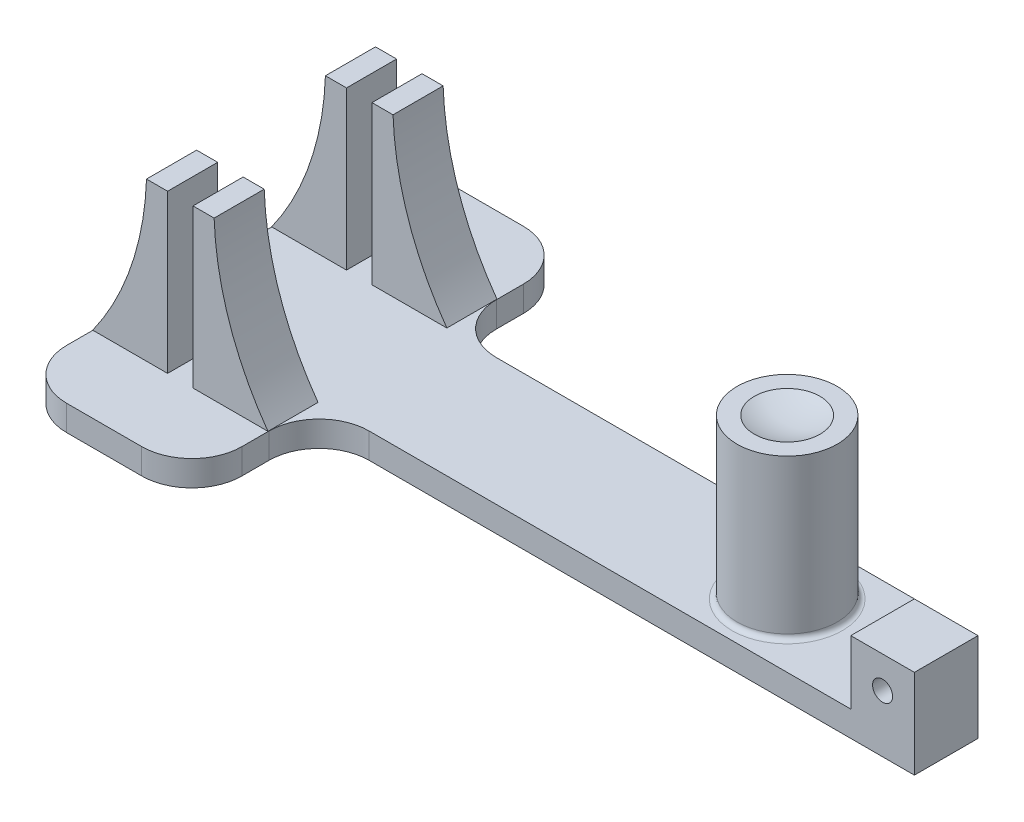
ISO-10303-21;
HEADER;
FILE_DESCRIPTION(('STEP AP214'),'2;1');
FILE_NAME('part.step','',(''),(''),'','','');
FILE_SCHEMA(('AUTOMOTIVE_DESIGN { 1 0 10303 214 1 1 1 1 }'));
ENDSEC;
DATA;
#1=APPLICATION_CONTEXT('core data for automotive mechanical design processes');
#2=APPLICATION_PROTOCOL_DEFINITION('international standard','automotive_design',2000,#1);
#3=PRODUCT_CONTEXT('',#1,'mechanical');
#4=PRODUCT('Part','Part','',(#3));
#5=PRODUCT_RELATED_PRODUCT_CATEGORY('part','',(#4));
#6=PRODUCT_DEFINITION_FORMATION('','',#4);
#7=PRODUCT_DEFINITION_CONTEXT('part definition',#1,'design');
#8=PRODUCT_DEFINITION('design','',#6,#7);
#9=PRODUCT_DEFINITION_SHAPE('','',#8);
#10=(LENGTH_UNIT() NAMED_UNIT(*) SI_UNIT(.MILLI.,.METRE.));
#11=(NAMED_UNIT(*) PLANE_ANGLE_UNIT() SI_UNIT($,.RADIAN.));
#12=(NAMED_UNIT(*) SI_UNIT($,.STERADIAN.) SOLID_ANGLE_UNIT());
#13=UNCERTAINTY_MEASURE_WITH_UNIT(LENGTH_MEASURE(1.E-05),#10,'distance_accuracy_value','');
#14=(GEOMETRIC_REPRESENTATION_CONTEXT(3) GLOBAL_UNCERTAINTY_ASSIGNED_CONTEXT((#13)) GLOBAL_UNIT_ASSIGNED_CONTEXT((#10,
#11,#12)) REPRESENTATION_CONTEXT('',''));
#15=CARTESIAN_POINT('',(0.,0.,0.));
#16=DIRECTION('',(0.,0.,1.));
#17=DIRECTION('',(1.,0.,0.));
#18=AXIS2_PLACEMENT_3D('',#15,#16,#17);
#19=CARTESIAN_POINT('',(30.08,0.,22.7));
#20=DIRECTION('',(0.,1.,0.));
#21=DIRECTION('',(0.,0.,1.));
#22=AXIS2_PLACEMENT_3D('',#19,#20,#21);
#23=PLANE('',#22);
#24=CARTESIAN_POINT('',(100.84,0.,0.));
#25=DIRECTION('',(0.,1.,0.));
#26=DIRECTION('',(0.,0.,1.));
#27=AXIS2_PLACEMENT_3D('',#24,#25,#26);
#28=CIRCLE('',#27,11.);
#29=CARTESIAN_POINT('',(100.84,0.,11.));
#30=VERTEX_POINT('',#29);
#31=EDGE_CURVE('E11',#30,#30,#28,.F.);
#32=ORIENTED_EDGE('',*,*,#31,.T.);
#33=EDGE_LOOP('',(#32));
#34=FACE_BOUND('',#33,.T.);
#35=DIRECTION('',(0.,0.,1.));
#36=VECTOR('',#35,1.);
#37=CARTESIAN_POINT('',(5.08,0.,12.86));
#38=LINE('',#37,#36);
#39=CARTESIAN_POINT('',(5.08,0.,12.86));
#40=VERTEX_POINT('',#39);
#41=CARTESIAN_POINT('',(5.08,0.,22.86));
#42=VERTEX_POINT('',#41);
#43=EDGE_CURVE('E375',#40,#42,#38,.T.);
#44=ORIENTED_EDGE('',*,*,#43,.F.);
#45=DIRECTION('',(1.,0.,0.));
#46=VECTOR('',#45,1.);
#47=CARTESIAN_POINT('',(5.08,0.,12.86));
#48=LINE('',#47,#46);
#49=CARTESIAN_POINT('',(20.033299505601,0.,12.86));
#50=VERTEX_POINT('',#49);
#51=EDGE_CURVE('E366',#40,#50,#48,.T.);
#52=ORIENTED_EDGE('',*,*,#51,.T.);
#53=DIRECTION('',(0.,0.,1.));
#54=VECTOR('',#53,1.);
#55=CARTESIAN_POINT('',(20.033299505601,0.,12.86));
#56=LINE('',#55,#54);
#57=CARTESIAN_POINT('',(20.033299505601,0.,22.86));
#58=VERTEX_POINT('',#57);
#59=EDGE_CURVE('E391',#50,#58,#56,.T.);
#60=ORIENTED_EDGE('',*,*,#59,.T.);
#61=DIRECTION('',(1.,0.,0.));
#62=VECTOR('',#61,1.);
#63=CARTESIAN_POINT('',(5.08,0.,22.86));
#64=LINE('',#63,#62);
#65=EDGE_CURVE('E378',#42,#58,#64,.T.);
#66=ORIENTED_EDGE('',*,*,#65,.F.);
#67=EDGE_LOOP('',(#44,#52,#60,#66));
#68=FACE_BOUND('',#67,.T.);
#69=DIRECTION('',(0.,0.,-1.));
#70=VECTOR('',#69,1.);
#71=CARTESIAN_POINT('',(20.033299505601,0.,-12.86));
#72=LINE('',#71,#70);
#73=CARTESIAN_POINT('',(20.033299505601,0.,-12.86));
#74=VERTEX_POINT('',#73);
#75=CARTESIAN_POINT('',(20.033299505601,0.,-22.86));
#76=VERTEX_POINT('',#75);
#77=EDGE_CURVE('E321',#74,#76,#72,.T.);
#78=ORIENTED_EDGE('',*,*,#77,.F.);
#79=DIRECTION('',(1.,0.,0.));
#80=VECTOR('',#79,1.);
#81=CARTESIAN_POINT('',(5.08,0.,-12.86));
#82=LINE('',#81,#80);
#83=CARTESIAN_POINT('',(5.08,0.,-12.86));
#84=VERTEX_POINT('',#83);
#85=EDGE_CURVE('E56',#84,#74,#82,.T.);
#86=ORIENTED_EDGE('',*,*,#85,.F.);
#87=DIRECTION('',(0.,0.,-1.));
#88=VECTOR('',#87,1.);
#89=CARTESIAN_POINT('',(5.08,0.,-12.86));
#90=LINE('',#89,#88);
#91=CARTESIAN_POINT('',(5.08,0.,-22.86));
#92=VERTEX_POINT('',#91);
#93=EDGE_CURVE('E318',#84,#92,#90,.T.);
#94=ORIENTED_EDGE('',*,*,#93,.T.);
#95=DIRECTION('',(1.,0.,0.));
#96=VECTOR('',#95,1.);
#97=CARTESIAN_POINT('',(5.08,0.,-22.86));
#98=LINE('',#97,#96);
#99=EDGE_CURVE('E305',#92,#76,#98,.T.);
#100=ORIENTED_EDGE('',*,*,#99,.T.);
#101=EDGE_LOOP('',(#78,#86,#94,#100));
#102=FACE_BOUND('',#101,.T.);
#103=DIRECTION('',(1.,0.,0.));
#104=VECTOR('',#103,1.);
#105=CARTESIAN_POINT('',(30.08,0.,12.7));
#106=LINE('',#105,#104);
#107=CARTESIAN_POINT('',(30.08,0.,12.7));
#108=VERTEX_POINT('',#107);
#109=CARTESIAN_POINT('',(126.24,0.,12.7));
#110=VERTEX_POINT('',#109);
#111=EDGE_CURVE('E48',#108,#110,#106,.T.);
#112=ORIENTED_EDGE('',*,*,#111,.T.);
#113=DIRECTION('',(0.,0.,1.));
#114=VECTOR('',#113,1.);
#115=CARTESIAN_POINT('',(126.24,0.,0.));
#116=LINE('',#115,#114);
#117=CARTESIAN_POINT('',(126.24,0.,0.));
#118=VERTEX_POINT('',#117);
#119=EDGE_CURVE('E287',#118,#110,#116,.T.);
#120=ORIENTED_EDGE('',*,*,#119,.F.);
#121=DIRECTION('',(0.,0.,-1.));
#122=VECTOR('',#121,1.);
#123=CARTESIAN_POINT('',(126.24,0.,-12.7));
#124=LINE('',#123,#122);
#125=CARTESIAN_POINT('',(126.24,0.,-12.7));
#126=VERTEX_POINT('',#125);
#127=EDGE_CURVE('E424',#118,#126,#124,.T.);
#128=ORIENTED_EDGE('',*,*,#127,.T.);
#129=DIRECTION('',(-1.,0.,0.));
#130=VECTOR('',#129,1.);
#131=CARTESIAN_POINT('',(30.08,0.,-12.7));
#132=LINE('',#131,#130);
#133=CARTESIAN_POINT('',(30.08,0.,-12.7));
#134=VERTEX_POINT('',#133);
#135=EDGE_CURVE('E479',#126,#134,#132,.T.);
#136=ORIENTED_EDGE('',*,*,#135,.T.);
#137=CARTESIAN_POINT('',(30.08,0.,-22.7));
#138=DIRECTION('',(0.,-1.,0.));
#139=DIRECTION('',(0.,0.,1.));
#140=AXIS2_PLACEMENT_3D('',#137,#138,#139);
#141=CIRCLE('',#140,10.);
#142=CARTESIAN_POINT('',(20.08,0.,-22.7));
#143=VERTEX_POINT('',#142);
#144=EDGE_CURVE('E482',#134,#143,#141,.T.);
#145=ORIENTED_EDGE('',*,*,#144,.T.);
#146=DIRECTION('',(0.,0.,-1.));
#147=VECTOR('',#146,1.);
#148=CARTESIAN_POINT('',(20.08,0.,-28.1));
#149=LINE('',#148,#147);
#150=CARTESIAN_POINT('',(20.08,0.,-28.1));
#151=VERTEX_POINT('',#150);
#152=EDGE_CURVE('E485',#143,#151,#149,.T.);
#153=ORIENTED_EDGE('',*,*,#152,.T.);
#154=CARTESIAN_POINT('',(10.08,0.,-28.1));
#155=DIRECTION('',(0.,1.,0.));
#156=DIRECTION('',(0.,0.,1.));
#157=AXIS2_PLACEMENT_3D('',#154,#155,#156);
#158=CIRCLE('',#157,10.);
#159=CARTESIAN_POINT('',(10.08,0.,-38.1));
#160=VERTEX_POINT('',#159);
#161=EDGE_CURVE('E488',#151,#160,#158,.T.);
#162=ORIENTED_EDGE('',*,*,#161,.T.);
#163=DIRECTION('',(-1.,0.,0.));
#164=VECTOR('',#163,1.);
#165=CARTESIAN_POINT('',(-4.92,0.,-38.1));
#166=LINE('',#165,#164);
#167=CARTESIAN_POINT('',(-4.91999999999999,0.,-38.1));
#168=VERTEX_POINT('',#167);
#169=EDGE_CURVE('E491',#160,#168,#166,.T.);
#170=ORIENTED_EDGE('',*,*,#169,.T.);
#171=CARTESIAN_POINT('',(-4.92,0.,-28.1));
#172=DIRECTION('',(0.,1.,0.));
#173=DIRECTION('',(0.,0.,1.));
#174=AXIS2_PLACEMENT_3D('',#171,#172,#173);
#175=CIRCLE('',#174,10.);
#176=CARTESIAN_POINT('',(-14.92,0.,-28.1));
#177=VERTEX_POINT('',#176);
#178=EDGE_CURVE('E494',#168,#177,#175,.T.);
#179=ORIENTED_EDGE('',*,*,#178,.T.);
#180=DIRECTION('',(0.,0.,1.));
#181=VECTOR('',#180,1.);
#182=CARTESIAN_POINT('',(-14.92,0.,-28.1));
#183=LINE('',#182,#181);
#184=CARTESIAN_POINT('',(-14.92,0.,-22.86));
#185=VERTEX_POINT('',#184);
#186=EDGE_CURVE('E498',#177,#185,#183,.T.);
#187=ORIENTED_EDGE('',*,*,#186,.T.);
#188=DIRECTION('',(1.,0.,0.));
#189=VECTOR('',#188,1.);
#190=CARTESIAN_POINT('',(0.,0.,-22.86));
#191=LINE('',#190,#189);
#192=CARTESIAN_POINT('',(0.,0.,-22.86));
#193=VERTEX_POINT('',#192);
#194=EDGE_CURVE('E344',#185,#193,#191,.T.);
#195=ORIENTED_EDGE('',*,*,#194,.T.);
#196=DIRECTION('',(0.,0.,-1.));
#197=VECTOR('',#196,1.);
#198=CARTESIAN_POINT('',(0.,0.,-12.86));
#199=LINE('',#198,#197);
#200=CARTESIAN_POINT('',(0.,0.,-12.86));
#201=VERTEX_POINT('',#200);
#202=EDGE_CURVE('E341',#201,#193,#199,.T.);
#203=ORIENTED_EDGE('',*,*,#202,.F.);
#204=DIRECTION('',(1.,0.,0.));
#205=VECTOR('',#204,1.);
#206=CARTESIAN_POINT('',(0.,0.,-12.86));
#207=LINE('',#206,#205);
#208=CARTESIAN_POINT('',(-14.92,0.,-12.86));
#209=VERTEX_POINT('',#208);
#210=EDGE_CURVE('E332',#209,#201,#207,.T.);
#211=ORIENTED_EDGE('',*,*,#210,.F.);
#212=CARTESIAN_POINT('',(-14.92,0.,12.86));
#213=VERTEX_POINT('',#212);
#214=EDGE_CURVE('E503',#209,#213,#183,.T.);
#215=ORIENTED_EDGE('',*,*,#214,.T.);
#216=DIRECTION('',(1.,0.,0.));
#217=VECTOR('',#216,1.);
#218=CARTESIAN_POINT('',(0.,0.,12.86));
#219=LINE('',#218,#217);
#220=CARTESIAN_POINT('',(0.,0.,12.86));
#221=VERTEX_POINT('',#220);
#222=EDGE_CURVE('E409',#213,#221,#219,.T.);
#223=ORIENTED_EDGE('',*,*,#222,.T.);
#224=DIRECTION('',(0.,0.,1.));
#225=VECTOR('',#224,1.);
#226=CARTESIAN_POINT('',(0.,0.,12.86));
#227=LINE('',#226,#225);
#228=CARTESIAN_POINT('',(0.,0.,22.86));
#229=VERTEX_POINT('',#228);
#230=EDGE_CURVE('E421',#221,#229,#227,.T.);
#231=ORIENTED_EDGE('',*,*,#230,.T.);
#232=DIRECTION('',(1.,0.,0.));
#233=VECTOR('',#232,1.);
#234=CARTESIAN_POINT('',(0.,0.,22.86));
#235=LINE('',#234,#233);
#236=CARTESIAN_POINT('',(-14.92,0.,22.86));
#237=VERTEX_POINT('',#236);
#238=EDGE_CURVE('E420',#237,#229,#235,.T.);
#239=ORIENTED_EDGE('',*,*,#238,.F.);
#240=CARTESIAN_POINT('',(-14.92,0.,28.1));
#241=VERTEX_POINT('',#240);
#242=EDGE_CURVE('E497',#237,#241,#183,.T.);
#243=ORIENTED_EDGE('',*,*,#242,.T.);
#244=CARTESIAN_POINT('',(-4.92,0.,28.1));
#245=DIRECTION('',(0.,1.,0.));
#246=DIRECTION('',(0.,0.,1.));
#247=AXIS2_PLACEMENT_3D('',#244,#245,#246);
#248=CIRCLE('',#247,10.);
#249=CARTESIAN_POINT('',(-4.92,0.,38.1));
#250=VERTEX_POINT('',#249);
#251=EDGE_CURVE('E501',#241,#250,#248,.T.);
#252=ORIENTED_EDGE('',*,*,#251,.T.);
#253=DIRECTION('',(1.,0.,0.));
#254=VECTOR('',#253,1.);
#255=CARTESIAN_POINT('',(-4.92,0.,38.1));
#256=LINE('',#255,#254);
#257=CARTESIAN_POINT('',(10.08,0.,38.1));
#258=VERTEX_POINT('',#257);
#259=EDGE_CURVE('E507',#250,#258,#256,.T.);
#260=ORIENTED_EDGE('',*,*,#259,.T.);
#261=CARTESIAN_POINT('',(10.08,0.,28.1));
#262=DIRECTION('',(0.,1.,0.));
#263=DIRECTION('',(0.,0.,-1.));
#264=AXIS2_PLACEMENT_3D('',#261,#262,#263);
#265=CIRCLE('',#264,10.);
#266=CARTESIAN_POINT('',(20.08,0.,28.1));
#267=VERTEX_POINT('',#266);
#268=EDGE_CURVE('E510',#258,#267,#265,.T.);
#269=ORIENTED_EDGE('',*,*,#268,.T.);
#270=DIRECTION('',(0.,0.,-1.));
#271=VECTOR('',#270,1.);
#272=CARTESIAN_POINT('',(20.08,0.,28.1));
#273=LINE('',#272,#271);
#274=CARTESIAN_POINT('',(20.08,0.,22.7));
#275=VERTEX_POINT('',#274);
#276=EDGE_CURVE('E513',#267,#275,#273,.T.);
#277=ORIENTED_EDGE('',*,*,#276,.T.);
#278=CARTESIAN_POINT('',(30.08,0.,22.7));
#279=DIRECTION('',(0.,-1.,0.));
#280=DIRECTION('',(0.,0.,1.));
#281=AXIS2_PLACEMENT_3D('',#278,#279,#280);
#282=CIRCLE('',#281,10.);
#283=EDGE_CURVE('E516',#275,#108,#282,.T.);
#284=ORIENTED_EDGE('',*,*,#283,.T.);
#285=EDGE_LOOP('',(#112,#120,#128,#136,#145,#153,#162,#170,#179,#187,#195,#203,#211,#215,#223,
#231,#239,#243,#252,#260,#269,#277,#284));
#286=FACE_BOUND('',#285,.T.);
#287=ADVANCED_FACE('F33',(#34,#68,#102,#286),#23,.T.);
#288=CARTESIAN_POINT('',(30.08,-5.08,12.7));
#289=DIRECTION('',(0.,0.,1.));
#290=DIRECTION('',(1.,0.,0.));
#291=AXIS2_PLACEMENT_3D('',#288,#289,#290);
#292=PLANE('',#291);
#293=CARTESIAN_POINT('',(132.59,6.35,12.7));
#294=DIRECTION('',(0.,0.,1.));
#295=DIRECTION('',(1.,0.,0.));
#296=AXIS2_PLACEMENT_3D('',#293,#294,#295);
#297=CIRCLE('',#296,2.);
#298=CARTESIAN_POINT('',(134.59,6.35,12.7));
#299=VERTEX_POINT('',#298);
#300=EDGE_CURVE('E687',#299,#299,#297,.T.);
#301=ORIENTED_EDGE('',*,*,#300,.F.);
#302=EDGE_LOOP('',(#301));
#303=FACE_BOUND('',#302,.T.);
#304=ORIENTED_EDGE('',*,*,#111,.F.);
#305=DIRECTION('',(0.,1.,0.));
#306=VECTOR('',#305,1.);
#307=CARTESIAN_POINT('',(30.08,-5.08,12.7));
#308=LINE('',#307,#306);
#309=CARTESIAN_POINT('',(30.08,-5.08,12.7));
#310=VERTEX_POINT('',#309);
#311=EDGE_CURVE('E519',#310,#108,#308,.T.);
#312=ORIENTED_EDGE('',*,*,#311,.F.);
#313=DIRECTION('',(1.,0.,0.));
#314=VECTOR('',#313,1.);
#315=CARTESIAN_POINT('',(138.94,-5.08,12.7));
#316=LINE('',#315,#314);
#317=CARTESIAN_POINT('',(138.94,-5.08,12.7));
#318=VERTEX_POINT('',#317);
#319=EDGE_CURVE('E430',#310,#318,#316,.T.);
#320=ORIENTED_EDGE('',*,*,#319,.T.);
#321=DIRECTION('',(0.,1.,0.));
#322=VECTOR('',#321,1.);
#323=CARTESIAN_POINT('',(138.94,-5.08,12.7));
#324=LINE('',#323,#322);
#325=CARTESIAN_POINT('',(138.94,12.7,12.7));
#326=VERTEX_POINT('',#325);
#327=EDGE_CURVE('E273',#318,#326,#324,.T.);
#328=ORIENTED_EDGE('',*,*,#327,.T.);
#329=DIRECTION('',(1.,0.,0.));
#330=VECTOR('',#329,1.);
#331=CARTESIAN_POINT('',(126.24,12.7,12.7));
#332=LINE('',#331,#330);
#333=CARTESIAN_POINT('',(126.24,12.7,12.7));
#334=VERTEX_POINT('',#333);
#335=EDGE_CURVE('E266',#334,#326,#332,.T.);
#336=ORIENTED_EDGE('',*,*,#335,.F.);
#337=DIRECTION('',(0.,-1.,0.));
#338=VECTOR('',#337,1.);
#339=CARTESIAN_POINT('',(126.24,12.7,12.7));
#340=LINE('',#339,#338);
#341=EDGE_CURVE('E270',#334,#110,#340,.T.);
#342=ORIENTED_EDGE('',*,*,#341,.T.);
#343=EDGE_LOOP('',(#304,#312,#320,#328,#336,#342));
#344=FACE_BOUND('',#343,.T.);
#345=ADVANCED_FACE('F268',(#303,#344),#292,.T.);
#346=CARTESIAN_POINT('',(30.08,-5.08,22.7));
#347=DIRECTION('',(0.,1.,0.));
#348=DIRECTION('',(0.,0.,1.));
#349=AXIS2_PLACEMENT_3D('',#346,#347,#348);
#350=CYLINDRICAL_SURFACE('',#349,10.);
#351=ORIENTED_EDGE('',*,*,#283,.F.);
#352=DIRECTION('',(0.,1.,0.));
#353=VECTOR('',#352,1.);
#354=CARTESIAN_POINT('',(20.08,-5.08,22.7));
#355=LINE('',#354,#353);
#356=CARTESIAN_POINT('',(20.08,-5.08,22.7));
#357=VERTEX_POINT('',#356);
#358=EDGE_CURVE('E521',#357,#275,#355,.T.);
#359=ORIENTED_EDGE('',*,*,#358,.F.);
#360=CARTESIAN_POINT('',(30.08,-5.08,22.7));
#361=DIRECTION('',(0.,-1.,0.));
#362=DIRECTION('',(0.,0.,1.));
#363=AXIS2_PLACEMENT_3D('',#360,#361,#362);
#364=CIRCLE('',#363,10.);
#365=EDGE_CURVE('E474',#357,#310,#364,.T.);
#366=ORIENTED_EDGE('',*,*,#365,.T.);
#367=ORIENTED_EDGE('',*,*,#311,.T.);
#368=EDGE_LOOP('',(#351,#359,#366,#367));
#369=FACE_BOUND('',#368,.T.);
#370=ADVANCED_FACE('F614',(#369),#350,.F.);
#371=CARTESIAN_POINT('',(20.08,-5.08,28.1));
#372=DIRECTION('',(1.,0.,0.));
#373=DIRECTION('',(0.,0.,-1.));
#374=AXIS2_PLACEMENT_3D('',#371,#372,#373);
#375=PLANE('',#374);
#376=ORIENTED_EDGE('',*,*,#276,.F.);
#377=DIRECTION('',(0.,1.,0.));
#378=VECTOR('',#377,1.);
#379=CARTESIAN_POINT('',(20.08,-5.08,28.1));
#380=LINE('',#379,#378);
#381=CARTESIAN_POINT('',(20.08,-5.08,28.1));
#382=VERTEX_POINT('',#381);
#383=EDGE_CURVE('E523',#382,#267,#380,.T.);
#384=ORIENTED_EDGE('',*,*,#383,.F.);
#385=DIRECTION('',(0.,0.,-1.));
#386=VECTOR('',#385,1.);
#387=CARTESIAN_POINT('',(20.08,-5.08,28.1));
#388=LINE('',#387,#386);
#389=EDGE_CURVE('E471',#382,#357,#388,.T.);
#390=ORIENTED_EDGE('',*,*,#389,.T.);
#391=ORIENTED_EDGE('',*,*,#358,.T.);
#392=EDGE_LOOP('',(#376,#384,#390,#391));
#393=FACE_BOUND('',#392,.T.);
#394=ADVANCED_FACE('F624',(#393),#375,.T.);
#395=CARTESIAN_POINT('',(10.08,-5.08,28.1));
#396=DIRECTION('',(0.,1.,0.));
#397=DIRECTION('',(0.,0.,1.));
#398=AXIS2_PLACEMENT_3D('',#395,#396,#397);
#399=CYLINDRICAL_SURFACE('',#398,10.);
#400=ORIENTED_EDGE('',*,*,#268,.F.);
#401=DIRECTION('',(0.,1.,0.));
#402=VECTOR('',#401,1.);
#403=CARTESIAN_POINT('',(10.08,-5.08,38.1));
#404=LINE('',#403,#402);
#405=CARTESIAN_POINT('',(10.08,-5.08,38.1));
#406=VERTEX_POINT('',#405);
#407=EDGE_CURVE('E525',#406,#258,#404,.T.);
#408=ORIENTED_EDGE('',*,*,#407,.F.);
#409=CARTESIAN_POINT('',(10.08,-5.08,28.1));
#410=DIRECTION('',(0.,1.,0.));
#411=DIRECTION('',(0.,0.,-1.));
#412=AXIS2_PLACEMENT_3D('',#409,#410,#411);
#413=CIRCLE('',#412,10.);
#414=EDGE_CURVE('E468',#406,#382,#413,.T.);
#415=ORIENTED_EDGE('',*,*,#414,.T.);
#416=ORIENTED_EDGE('',*,*,#383,.T.);
#417=EDGE_LOOP('',(#400,#408,#415,#416));
#418=FACE_BOUND('',#417,.T.);
#419=ADVANCED_FACE('F628',(#418),#399,.T.);
#420=CARTESIAN_POINT('',(-4.92,-5.08,38.1));
#421=DIRECTION('',(0.,0.,1.));
#422=DIRECTION('',(1.,0.,0.));
#423=AXIS2_PLACEMENT_3D('',#420,#421,#422);
#424=PLANE('',#423);
#425=ORIENTED_EDGE('',*,*,#259,.F.);
#426=DIRECTION('',(0.,1.,0.));
#427=VECTOR('',#426,1.);
#428=CARTESIAN_POINT('',(-4.92,-5.08,38.1));
#429=LINE('',#428,#427);
#430=CARTESIAN_POINT('',(-4.92,-5.08,38.1));
#431=VERTEX_POINT('',#430);
#432=EDGE_CURVE('E527',#431,#250,#429,.T.);
#433=ORIENTED_EDGE('',*,*,#432,.F.);
#434=DIRECTION('',(1.,0.,0.));
#435=VECTOR('',#434,1.);
#436=CARTESIAN_POINT('',(-4.92,-5.08,38.1));
#437=LINE('',#436,#435);
#438=EDGE_CURVE('E465',#431,#406,#437,.T.);
#439=ORIENTED_EDGE('',*,*,#438,.T.);
#440=ORIENTED_EDGE('',*,*,#407,.T.);
#441=EDGE_LOOP('',(#425,#433,#439,#440));
#442=FACE_BOUND('',#441,.T.);
#443=ADVANCED_FACE('F632',(#442),#424,.T.);
#444=CARTESIAN_POINT('',(-4.92,-5.08,28.1));
#445=DIRECTION('',(0.,1.,0.));
#446=DIRECTION('',(0.,0.,1.));
#447=AXIS2_PLACEMENT_3D('',#444,#445,#446);
#448=CYLINDRICAL_SURFACE('',#447,10.);
#449=ORIENTED_EDGE('',*,*,#251,.F.);
#450=DIRECTION('',(0.,1.,0.));
#451=VECTOR('',#450,1.);
#452=CARTESIAN_POINT('',(-14.92,-5.08,28.1));
#453=LINE('',#452,#451);
#454=CARTESIAN_POINT('',(-14.92,-5.08,28.1));
#455=VERTEX_POINT('',#454);
#456=EDGE_CURVE('E529',#455,#241,#453,.T.);
#457=ORIENTED_EDGE('',*,*,#456,.F.);
#458=CARTESIAN_POINT('',(-4.92,-5.08,28.1));
#459=DIRECTION('',(0.,1.,0.));
#460=DIRECTION('',(0.,0.,1.));
#461=AXIS2_PLACEMENT_3D('',#458,#459,#460);
#462=CIRCLE('',#461,10.);
#463=EDGE_CURVE('E462',#455,#431,#462,.T.);
#464=ORIENTED_EDGE('',*,*,#463,.T.);
#465=ORIENTED_EDGE('',*,*,#432,.T.);
#466=EDGE_LOOP('',(#449,#457,#464,#465));
#467=FACE_BOUND('',#466,.T.);
#468=ADVANCED_FACE('F636',(#467),#448,.T.);
#469=CARTESIAN_POINT('',(-14.92,-5.08,-28.1));
#470=DIRECTION('',(-1.,0.,0.));
#471=DIRECTION('',(0.,0.,1.));
#472=AXIS2_PLACEMENT_3D('',#469,#470,#471);
#473=PLANE('',#472);
#474=ORIENTED_EDGE('',*,*,#186,.F.);
#475=DIRECTION('',(0.,1.,0.));
#476=VECTOR('',#475,1.);
#477=CARTESIAN_POINT('',(-14.92,-5.08,-28.1));
#478=LINE('',#477,#476);
#479=CARTESIAN_POINT('',(-14.92,-5.08,-28.1));
#480=VERTEX_POINT('',#479);
#481=EDGE_CURVE('E532',#480,#177,#478,.T.);
#482=ORIENTED_EDGE('',*,*,#481,.F.);
#483=DIRECTION('',(0.,0.,1.));
#484=VECTOR('',#483,1.);
#485=CARTESIAN_POINT('',(-14.92,-5.08,-28.1));
#486=LINE('',#485,#484);
#487=EDGE_CURVE('E459',#480,#455,#486,.T.);
#488=ORIENTED_EDGE('',*,*,#487,.T.);
#489=ORIENTED_EDGE('',*,*,#456,.T.);
#490=ORIENTED_EDGE('',*,*,#242,.F.);
#491=EDGE_CURVE('E504',#213,#237,#183,.T.);
#492=ORIENTED_EDGE('',*,*,#491,.F.);
#493=ORIENTED_EDGE('',*,*,#214,.F.);
#494=EDGE_CURVE('E502',#185,#209,#183,.T.);
#495=ORIENTED_EDGE('',*,*,#494,.F.);
#496=EDGE_LOOP('',(#474,#482,#488,#489,#490,#492,#493,#495));
#497=FACE_BOUND('',#496,.T.);
#498=ADVANCED_FACE('F573',(#497),#473,.T.);
#499=CARTESIAN_POINT('',(-4.92,-5.08,-28.1));
#500=DIRECTION('',(0.,1.,0.));
#501=DIRECTION('',(0.,0.,1.));
#502=AXIS2_PLACEMENT_3D('',#499,#500,#501);
#503=CYLINDRICAL_SURFACE('',#502,10.);
#504=ORIENTED_EDGE('',*,*,#178,.F.);
#505=DIRECTION('',(0.,1.,0.));
#506=VECTOR('',#505,1.);
#507=CARTESIAN_POINT('',(-4.91999999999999,-5.08,-38.1));
#508=LINE('',#507,#506);
#509=CARTESIAN_POINT('',(-4.91999999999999,-5.08,-38.1));
#510=VERTEX_POINT('',#509);
#511=EDGE_CURVE('E534',#510,#168,#508,.T.);
#512=ORIENTED_EDGE('',*,*,#511,.F.);
#513=CARTESIAN_POINT('',(-4.92,-5.08,-28.1));
#514=DIRECTION('',(0.,1.,0.));
#515=DIRECTION('',(0.,0.,1.));
#516=AXIS2_PLACEMENT_3D('',#513,#514,#515);
#517=CIRCLE('',#516,10.);
#518=EDGE_CURVE('E456',#510,#480,#517,.T.);
#519=ORIENTED_EDGE('',*,*,#518,.T.);
#520=ORIENTED_EDGE('',*,*,#481,.T.);
#521=EDGE_LOOP('',(#504,#512,#519,#520));
#522=FACE_BOUND('',#521,.T.);
#523=ADVANCED_FACE('F643',(#522),#503,.T.);
#524=CARTESIAN_POINT('',(-4.92,-5.08,-38.1));
#525=DIRECTION('',(0.,0.,-1.));
#526=DIRECTION('',(-1.,0.,0.));
#527=AXIS2_PLACEMENT_3D('',#524,#525,#526);
#528=PLANE('',#527);
#529=ORIENTED_EDGE('',*,*,#169,.F.);
#530=DIRECTION('',(0.,1.,0.));
#531=VECTOR('',#530,1.);
#532=CARTESIAN_POINT('',(10.08,-5.08,-38.1));
#533=LINE('',#532,#531);
#534=CARTESIAN_POINT('',(10.08,-5.08,-38.1));
#535=VERTEX_POINT('',#534);
#536=EDGE_CURVE('E536',#535,#160,#533,.T.);
#537=ORIENTED_EDGE('',*,*,#536,.F.);
#538=DIRECTION('',(-1.,0.,0.));
#539=VECTOR('',#538,1.);
#540=CARTESIAN_POINT('',(-4.92,-5.08,-38.1));
#541=LINE('',#540,#539);
#542=EDGE_CURVE('E453',#535,#510,#541,.T.);
#543=ORIENTED_EDGE('',*,*,#542,.T.);
#544=ORIENTED_EDGE('',*,*,#511,.T.);
#545=EDGE_LOOP('',(#529,#537,#543,#544));
#546=FACE_BOUND('',#545,.T.);
#547=ADVANCED_FACE('F646',(#546),#528,.T.);
#548=CARTESIAN_POINT('',(10.08,-5.08,-28.1));
#549=DIRECTION('',(0.,1.,0.));
#550=DIRECTION('',(0.,0.,1.));
#551=AXIS2_PLACEMENT_3D('',#548,#549,#550);
#552=CYLINDRICAL_SURFACE('',#551,10.);
#553=ORIENTED_EDGE('',*,*,#161,.F.);
#554=DIRECTION('',(0.,1.,0.));
#555=VECTOR('',#554,1.);
#556=CARTESIAN_POINT('',(20.08,-5.08,-28.1));
#557=LINE('',#556,#555);
#558=CARTESIAN_POINT('',(20.08,-5.08,-28.1));
#559=VERTEX_POINT('',#558);
#560=EDGE_CURVE('E538',#559,#151,#557,.T.);
#561=ORIENTED_EDGE('',*,*,#560,.F.);
#562=CARTESIAN_POINT('',(10.08,-5.08,-28.1));
#563=DIRECTION('',(0.,1.,0.));
#564=DIRECTION('',(0.,0.,1.));
#565=AXIS2_PLACEMENT_3D('',#562,#563,#564);
#566=CIRCLE('',#565,10.);
#567=EDGE_CURVE('E450',#559,#535,#566,.T.);
#568=ORIENTED_EDGE('',*,*,#567,.T.);
#569=ORIENTED_EDGE('',*,*,#536,.T.);
#570=EDGE_LOOP('',(#553,#561,#568,#569));
#571=FACE_BOUND('',#570,.T.);
#572=ADVANCED_FACE('F650',(#571),#552,.T.);
#573=CARTESIAN_POINT('',(20.08,-5.08,-28.1));
#574=DIRECTION('',(1.,0.,0.));
#575=DIRECTION('',(0.,0.,-1.));
#576=AXIS2_PLACEMENT_3D('',#573,#574,#575);
#577=PLANE('',#576);
#578=ORIENTED_EDGE('',*,*,#152,.F.);
#579=DIRECTION('',(0.,1.,0.));
#580=VECTOR('',#579,1.);
#581=CARTESIAN_POINT('',(20.08,-5.08,-22.7));
#582=LINE('',#581,#580);
#583=CARTESIAN_POINT('',(20.08,-5.08,-22.7));
#584=VERTEX_POINT('',#583);
#585=EDGE_CURVE('E540',#584,#143,#582,.T.);
#586=ORIENTED_EDGE('',*,*,#585,.F.);
#587=DIRECTION('',(0.,0.,-1.));
#588=VECTOR('',#587,1.);
#589=CARTESIAN_POINT('',(20.08,-5.08,-28.1));
#590=LINE('',#589,#588);
#591=EDGE_CURVE('E447',#584,#559,#590,.T.);
#592=ORIENTED_EDGE('',*,*,#591,.T.);
#593=ORIENTED_EDGE('',*,*,#560,.T.);
#594=EDGE_LOOP('',(#578,#586,#592,#593));
#595=FACE_BOUND('',#594,.T.);
#596=ADVANCED_FACE('F654',(#595),#577,.T.);
#597=CARTESIAN_POINT('',(30.08,-5.08,-22.7));
#598=DIRECTION('',(0.,1.,0.));
#599=DIRECTION('',(0.,0.,1.));
#600=AXIS2_PLACEMENT_3D('',#597,#598,#599);
#601=CYLINDRICAL_SURFACE('',#600,10.);
#602=ORIENTED_EDGE('',*,*,#144,.F.);
#603=DIRECTION('',(0.,1.,0.));
#604=VECTOR('',#603,1.);
#605=CARTESIAN_POINT('',(30.08,-5.08,-12.7));
#606=LINE('',#605,#604);
#607=CARTESIAN_POINT('',(30.08,-5.08,-12.7));
#608=VERTEX_POINT('',#607);
#609=EDGE_CURVE('E542',#608,#134,#606,.T.);
#610=ORIENTED_EDGE('',*,*,#609,.F.);
#611=CARTESIAN_POINT('',(30.08,-5.08,-22.7));
#612=DIRECTION('',(0.,-1.,0.));
#613=DIRECTION('',(0.,0.,1.));
#614=AXIS2_PLACEMENT_3D('',#611,#612,#613);
#615=CIRCLE('',#614,10.);
#616=EDGE_CURVE('E444',#608,#584,#615,.T.);
#617=ORIENTED_EDGE('',*,*,#616,.T.);
#618=ORIENTED_EDGE('',*,*,#585,.T.);
#619=EDGE_LOOP('',(#602,#610,#617,#618));
#620=FACE_BOUND('',#619,.T.);
#621=ADVANCED_FACE('F658',(#620),#601,.F.);
#622=CARTESIAN_POINT('',(30.08,-5.08,-12.7));
#623=DIRECTION('',(0.,0.,-1.));
#624=DIRECTION('',(-1.,0.,0.));
#625=AXIS2_PLACEMENT_3D('',#622,#623,#624);
#626=PLANE('',#625);
#627=ORIENTED_EDGE('',*,*,#135,.F.);
#628=DIRECTION('',(0.,1.,0.));
#629=VECTOR('',#628,1.);
#630=CARTESIAN_POINT('',(126.24,-5.08,-12.7));
#631=LINE('',#630,#629);
#632=CARTESIAN_POINT('',(126.24,-5.08,-12.7));
#633=VERTEX_POINT('',#632);
#634=EDGE_CURVE('E544',#633,#126,#631,.T.);
#635=ORIENTED_EDGE('',*,*,#634,.F.);
#636=DIRECTION('',(-1.,0.,0.));
#637=VECTOR('',#636,1.);
#638=CARTESIAN_POINT('',(30.08,-5.08,-12.7));
#639=LINE('',#638,#637);
#640=EDGE_CURVE('E441',#633,#608,#639,.T.);
#641=ORIENTED_EDGE('',*,*,#640,.T.);
#642=ORIENTED_EDGE('',*,*,#609,.T.);
#643=EDGE_LOOP('',(#627,#635,#641,#642));
#644=FACE_BOUND('',#643,.T.);
#645=ADVANCED_FACE('F662',(#644),#626,.T.);
#646=CARTESIAN_POINT('',(126.24,-5.08,-12.7));
#647=DIRECTION('',(1.,0.,0.));
#648=DIRECTION('',(0.,0.,-1.));
#649=AXIS2_PLACEMENT_3D('',#646,#647,#648);
#650=PLANE('',#649);
#651=ORIENTED_EDGE('',*,*,#127,.F.);
#652=DIRECTION('',(0.,1.,0.));
#653=VECTOR('',#652,1.);
#654=CARTESIAN_POINT('',(126.24,-5.08,0.));
#655=LINE('',#654,#653);
#656=CARTESIAN_POINT('',(126.24,-5.08,0.));
#657=VERTEX_POINT('',#656);
#658=EDGE_CURVE('E546',#657,#118,#655,.T.);
#659=ORIENTED_EDGE('',*,*,#658,.F.);
#660=DIRECTION('',(0.,0.,-1.));
#661=VECTOR('',#660,1.);
#662=CARTESIAN_POINT('',(126.24,-5.08,-12.7));
#663=LINE('',#662,#661);
#664=EDGE_CURVE('E438',#657,#633,#663,.T.);
#665=ORIENTED_EDGE('',*,*,#664,.T.);
#666=ORIENTED_EDGE('',*,*,#634,.T.);
#667=EDGE_LOOP('',(#651,#659,#665,#666));
#668=FACE_BOUND('',#667,.T.);
#669=ADVANCED_FACE('F666',(#668),#650,.T.);
#670=CARTESIAN_POINT('',(126.24,-5.08,0.));
#671=DIRECTION('',(0.,0.,-1.));
#672=DIRECTION('',(-1.,0.,0.));
#673=AXIS2_PLACEMENT_3D('',#670,#671,#672);
#674=PLANE('',#673);
#675=CARTESIAN_POINT('',(132.59,6.35,0.));
#676=DIRECTION('',(0.,0.,1.));
#677=DIRECTION('',(1.,0.,0.));
#678=AXIS2_PLACEMENT_3D('',#675,#676,#677);
#679=CIRCLE('',#678,2.);
#680=CARTESIAN_POINT('',(134.59,6.35,0.));
#681=VERTEX_POINT('',#680);
#682=EDGE_CURVE('E689',#681,#681,#679,.T.);
#683=ORIENTED_EDGE('',*,*,#682,.T.);
#684=EDGE_LOOP('',(#683));
#685=FACE_BOUND('',#684,.T.);
#686=ORIENTED_EDGE('',*,*,#658,.T.);
#687=DIRECTION('',(0.,-1.,0.));
#688=VECTOR('',#687,1.);
#689=CARTESIAN_POINT('',(126.24,12.7,0.));
#690=LINE('',#689,#688);
#691=CARTESIAN_POINT('',(126.24,12.7,0.));
#692=VERTEX_POINT('',#691);
#693=EDGE_CURVE('E291',#692,#118,#690,.T.);
#694=ORIENTED_EDGE('',*,*,#693,.F.);
#695=DIRECTION('',(-1.,0.,0.));
#696=VECTOR('',#695,1.);
#697=CARTESIAN_POINT('',(126.24,12.7,0.));
#698=LINE('',#697,#696);
#699=CARTESIAN_POINT('',(138.94,12.7,0.));
#700=VERTEX_POINT('',#699);
#701=EDGE_CURVE('E283',#700,#692,#698,.T.);
#702=ORIENTED_EDGE('',*,*,#701,.F.);
#703=DIRECTION('',(0.,1.,0.));
#704=VECTOR('',#703,1.);
#705=CARTESIAN_POINT('',(138.94,-5.08,0.));
#706=LINE('',#705,#704);
#707=CARTESIAN_POINT('',(138.94,-5.08,0.));
#708=VERTEX_POINT('',#707);
#709=EDGE_CURVE('E549',#708,#700,#706,.T.);
#710=ORIENTED_EDGE('',*,*,#709,.F.);
#711=DIRECTION('',(-1.,0.,0.));
#712=VECTOR('',#711,1.);
#713=CARTESIAN_POINT('',(126.24,-5.08,0.));
#714=LINE('',#713,#712);
#715=EDGE_CURVE('E435',#708,#657,#714,.T.);
#716=ORIENTED_EDGE('',*,*,#715,.T.);
#717=EDGE_LOOP('',(#686,#694,#702,#710,#716));
#718=FACE_BOUND('',#717,.T.);
#719=ADVANCED_FACE('F670',(#685,#718),#674,.T.);
#720=CARTESIAN_POINT('',(138.94,-5.08,0.));
#721=DIRECTION('',(1.,0.,0.));
#722=DIRECTION('',(0.,0.,-1.));
#723=AXIS2_PLACEMENT_3D('',#720,#721,#722);
#724=PLANE('',#723);
#725=ORIENTED_EDGE('',*,*,#709,.T.);
#726=DIRECTION('',(0.,0.,-1.));
#727=VECTOR('',#726,1.);
#728=CARTESIAN_POINT('',(138.94,12.7,0.));
#729=LINE('',#728,#727);
#730=EDGE_CURVE('E277',#326,#700,#729,.T.);
#731=ORIENTED_EDGE('',*,*,#730,.F.);
#732=ORIENTED_EDGE('',*,*,#327,.F.);
#733=DIRECTION('',(0.,0.,-1.));
#734=VECTOR('',#733,1.);
#735=CARTESIAN_POINT('',(138.94,-5.08,0.));
#736=LINE('',#735,#734);
#737=EDGE_CURVE('E432',#318,#708,#736,.T.);
#738=ORIENTED_EDGE('',*,*,#737,.T.);
#739=EDGE_LOOP('',(#725,#731,#732,#738));
#740=FACE_BOUND('',#739,.T.);
#741=ADVANCED_FACE('F673',(#740),#724,.T.);
#742=CARTESIAN_POINT('',(30.08,-5.08,22.7));
#743=DIRECTION('',(0.,1.,0.));
#744=DIRECTION('',(0.,0.,1.));
#745=AXIS2_PLACEMENT_3D('',#742,#743,#744);
#746=PLANE('',#745);
#747=ORIENTED_EDGE('',*,*,#319,.F.);
#748=ORIENTED_EDGE('',*,*,#365,.F.);
#749=ORIENTED_EDGE('',*,*,#389,.F.);
#750=ORIENTED_EDGE('',*,*,#414,.F.);
#751=ORIENTED_EDGE('',*,*,#438,.F.);
#752=ORIENTED_EDGE('',*,*,#463,.F.);
#753=ORIENTED_EDGE('',*,*,#487,.F.);
#754=ORIENTED_EDGE('',*,*,#518,.F.);
#755=ORIENTED_EDGE('',*,*,#542,.F.);
#756=ORIENTED_EDGE('',*,*,#567,.F.);
#757=ORIENTED_EDGE('',*,*,#591,.F.);
#758=ORIENTED_EDGE('',*,*,#616,.F.);
#759=ORIENTED_EDGE('',*,*,#640,.F.);
#760=ORIENTED_EDGE('',*,*,#664,.F.);
#761=ORIENTED_EDGE('',*,*,#715,.F.);
#762=ORIENTED_EDGE('',*,*,#737,.F.);
#763=EDGE_LOOP('',(#747,#748,#749,#750,#751,#752,#753,#754,#755,#756,#757,#758,#759,#760,#761,#762));
#764=FACE_BOUND('',#763,.T.);
#765=ADVANCED_FACE('F619',(#764),#746,.F.);
#766=CARTESIAN_POINT('',(0.,0.,12.86));
#767=DIRECTION('',(1.,0.,0.));
#768=DIRECTION('',(0.,0.,-1.));
#769=AXIS2_PLACEMENT_3D('',#766,#767,#768);
#770=PLANE('',#769);
#771=DIRECTION('',(0.,1.,0.));
#772=VECTOR('',#771,1.);
#773=CARTESIAN_POINT('',(0.,0.,22.86));
#774=LINE('',#773,#772);
#775=CARTESIAN_POINT('',(0.,31.5,22.86));
#776=VERTEX_POINT('',#775);
#777=EDGE_CURVE('E388',#229,#776,#774,.T.);
#778=ORIENTED_EDGE('',*,*,#777,.F.);
#779=ORIENTED_EDGE('',*,*,#230,.F.);
#780=DIRECTION('',(0.,1.,0.));
#781=VECTOR('',#780,1.);
#782=CARTESIAN_POINT('',(0.,0.,12.86));
#783=LINE('',#782,#781);
#784=CARTESIAN_POINT('',(0.,31.5,12.86));
#785=VERTEX_POINT('',#784);
#786=EDGE_CURVE('E395',#221,#785,#783,.T.);
#787=ORIENTED_EDGE('',*,*,#786,.T.);
#788=DIRECTION('',(0.,0.,1.));
#789=VECTOR('',#788,1.);
#790=CARTESIAN_POINT('',(0.,31.5,12.86));
#791=LINE('',#790,#789);
#792=EDGE_CURVE('E408',#785,#776,#791,.T.);
#793=ORIENTED_EDGE('',*,*,#792,.T.);
#794=EDGE_LOOP('',(#778,#779,#787,#793));
#795=FACE_BOUND('',#794,.T.);
#796=ADVANCED_FACE('F680',(#795),#770,.T.);
#797=CARTESIAN_POINT('',(0.,0.,12.86));
#798=DIRECTION('',(0.,-1.,0.));
#799=DIRECTION('',(0.,0.,-1.));
#800=AXIS2_PLACEMENT_3D('',#797,#798,#799);
#801=PLANE('',#800);
#802=CARTESIAN_POINT('',(-14.953299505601,0.,12.86));
#803=VERTEX_POINT('',#802);
#804=EDGE_CURVE('E405',#803,#213,#219,.T.);
#805=ORIENTED_EDGE('',*,*,#804,.T.);
#806=ORIENTED_EDGE('',*,*,#491,.T.);
#807=CARTESIAN_POINT('',(-14.953299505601,0.,22.86));
#808=VERTEX_POINT('',#807);
#809=EDGE_CURVE('E399',#808,#237,#235,.T.);
#810=ORIENTED_EDGE('',*,*,#809,.F.);
#811=DIRECTION('',(0.,0.,1.));
#812=VECTOR('',#811,1.);
#813=CARTESIAN_POINT('',(-14.953299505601,0.,12.86));
#814=LINE('',#813,#812);
#815=EDGE_CURVE('E425',#803,#808,#814,.T.);
#816=ORIENTED_EDGE('',*,*,#815,.F.);
#817=EDGE_LOOP('',(#805,#806,#810,#816));
#818=FACE_BOUND('',#817,.T.);
#819=ADVANCED_FACE('F568',(#818),#801,.T.);
#820=CARTESIAN_POINT('',(-61.7361496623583,33.5385721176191,12.86));
#821=DIRECTION('',(0.,0.,1.));
#822=DIRECTION('',(1.,0.,0.));
#823=AXIS2_PLACEMENT_3D('',#820,#821,#822);
#824=CYLINDRICAL_SURFACE('',#823,57.5627560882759);
#825=CARTESIAN_POINT('',(-61.7361496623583,33.5385721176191,22.86));
#826=DIRECTION('',(0.,0.,-1.));
#827=DIRECTION('',(-1.,0.,0.));
#828=AXIS2_PLACEMENT_3D('',#825,#826,#827);
#829=CIRCLE('',#828,57.5627560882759);
#830=CARTESIAN_POINT('',(-4.20950268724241,31.5,22.86));
#831=VERTEX_POINT('',#830);
#832=EDGE_CURVE('E415',#831,#808,#829,.T.);
#833=ORIENTED_EDGE('',*,*,#832,.F.);
#834=DIRECTION('',(0.,0.,1.));
#835=VECTOR('',#834,1.);
#836=CARTESIAN_POINT('',(-4.20950268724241,31.5,12.86));
#837=LINE('',#836,#835);
#838=CARTESIAN_POINT('',(-4.20950268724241,31.5,12.86));
#839=VERTEX_POINT('',#838);
#840=EDGE_CURVE('E427',#839,#831,#837,.T.);
#841=ORIENTED_EDGE('',*,*,#840,.F.);
#842=CARTESIAN_POINT('',(-61.7361496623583,33.5385721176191,12.86));
#843=DIRECTION('',(0.,0.,-1.));
#844=DIRECTION('',(-1.,0.,0.));
#845=AXIS2_PLACEMENT_3D('',#842,#843,#844);
#846=CIRCLE('',#845,57.5627560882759);
#847=EDGE_CURVE('E402',#839,#803,#846,.T.);
#848=ORIENTED_EDGE('',*,*,#847,.T.);
#849=ORIENTED_EDGE('',*,*,#815,.T.);
#850=EDGE_LOOP('',(#833,#841,#848,#849));
#851=FACE_BOUND('',#850,.T.);
#852=ADVANCED_FACE('F923',(#851),#824,.F.);
#853=CARTESIAN_POINT('',(0.,31.5,12.86));
#854=DIRECTION('',(0.,1.,0.));
#855=DIRECTION('',(0.,0.,1.));
#856=AXIS2_PLACEMENT_3D('',#853,#854,#855);
#857=PLANE('',#856);
#858=DIRECTION('',(-1.,0.,0.));
#859=VECTOR('',#858,1.);
#860=CARTESIAN_POINT('',(0.,31.5,22.86));
#861=LINE('',#860,#859);
#862=EDGE_CURVE('E412',#776,#831,#861,.T.);
#863=ORIENTED_EDGE('',*,*,#862,.F.);
#864=ORIENTED_EDGE('',*,*,#792,.F.);
#865=DIRECTION('',(-1.,0.,0.));
#866=VECTOR('',#865,1.);
#867=CARTESIAN_POINT('',(0.,31.5,12.86));
#868=LINE('',#867,#866);
#869=EDGE_CURVE('E398',#785,#839,#868,.T.);
#870=ORIENTED_EDGE('',*,*,#869,.T.);
#871=ORIENTED_EDGE('',*,*,#840,.T.);
#872=EDGE_LOOP('',(#863,#864,#870,#871));
#873=FACE_BOUND('',#872,.T.);
#874=ADVANCED_FACE('F931',(#873),#857,.T.);
#875=CARTESIAN_POINT('',(-61.7361496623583,33.5385721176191,12.86));
#876=DIRECTION('',(0.,0.,-1.));
#877=DIRECTION('',(-1.,0.,0.));
#878=AXIS2_PLACEMENT_3D('',#875,#876,#877);
#879=PLANE('',#878);
#880=ORIENTED_EDGE('',*,*,#786,.F.);
#881=ORIENTED_EDGE('',*,*,#222,.F.);
#882=ORIENTED_EDGE('',*,*,#804,.F.);
#883=ORIENTED_EDGE('',*,*,#847,.F.);
#884=ORIENTED_EDGE('',*,*,#869,.F.);
#885=EDGE_LOOP('',(#880,#881,#882,#883,#884));
#886=FACE_BOUND('',#885,.T.);
#887=ADVANCED_FACE('F563',(#886),#879,.T.);
#888=CARTESIAN_POINT('',(-61.7361496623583,33.5385721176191,22.86));
#889=DIRECTION('',(0.,0.,-1.));
#890=DIRECTION('',(-1.,0.,0.));
#891=AXIS2_PLACEMENT_3D('',#888,#889,#890);
#892=PLANE('',#891);
#893=ORIENTED_EDGE('',*,*,#777,.T.);
#894=ORIENTED_EDGE('',*,*,#862,.T.);
#895=ORIENTED_EDGE('',*,*,#832,.T.);
#896=ORIENTED_EDGE('',*,*,#809,.T.);
#897=ORIENTED_EDGE('',*,*,#238,.T.);
#898=EDGE_LOOP('',(#893,#894,#895,#896,#897));
#899=FACE_BOUND('',#898,.T.);
#900=ADVANCED_FACE('F948',(#899),#892,.F.);
#901=CARTESIAN_POINT('',(5.08,0.,12.86));
#902=DIRECTION('',(-1.,0.,0.));
#903=DIRECTION('',(0.,-1.,0.));
#904=AXIS2_PLACEMENT_3D('',#901,#902,#903);
#905=PLANE('',#904);
#906=DIRECTION('',(0.,-1.,0.));
#907=VECTOR('',#906,1.);
#908=CARTESIAN_POINT('',(5.08,0.,22.86));
#909=LINE('',#908,#907);
#910=CARTESIAN_POINT('',(5.08,31.5,22.86));
#911=VERTEX_POINT('',#910);
#912=EDGE_CURVE('E354',#911,#42,#909,.T.);
#913=ORIENTED_EDGE('',*,*,#912,.F.);
#914=DIRECTION('',(0.,0.,1.));
#915=VECTOR('',#914,1.);
#916=CARTESIAN_POINT('',(5.08,31.5,12.86));
#917=LINE('',#916,#915);
#918=CARTESIAN_POINT('',(5.08,31.5,12.86));
#919=VERTEX_POINT('',#918);
#920=EDGE_CURVE('E386',#919,#911,#917,.T.);
#921=ORIENTED_EDGE('',*,*,#920,.F.);
#922=DIRECTION('',(0.,-1.,0.));
#923=VECTOR('',#922,1.);
#924=CARTESIAN_POINT('',(5.08,0.,12.86));
#925=LINE('',#924,#923);
#926=EDGE_CURVE('E363',#919,#40,#925,.T.);
#927=ORIENTED_EDGE('',*,*,#926,.T.);
#928=ORIENTED_EDGE('',*,*,#43,.T.);
#929=EDGE_LOOP('',(#913,#921,#927,#928));
#930=FACE_BOUND('',#929,.T.);
#931=ADVANCED_FACE('F956',(#930),#905,.T.);
#932=CARTESIAN_POINT('',(5.08,31.5,12.86));
#933=DIRECTION('',(0.,1.,0.));
#934=DIRECTION('',(0.,0.,1.));
#935=AXIS2_PLACEMENT_3D('',#932,#933,#934);
#936=PLANE('',#935);
#937=DIRECTION('',(-1.,0.,0.));
#938=VECTOR('',#937,1.);
#939=CARTESIAN_POINT('',(5.08,31.5,22.86));
#940=LINE('',#939,#938);
#941=CARTESIAN_POINT('',(9.28950268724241,31.5,22.86));
#942=VERTEX_POINT('',#941);
#943=EDGE_CURVE('E367',#942,#911,#940,.T.);
#944=ORIENTED_EDGE('',*,*,#943,.F.);
#945=DIRECTION('',(0.,0.,1.));
#946=VECTOR('',#945,1.);
#947=CARTESIAN_POINT('',(9.28950268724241,31.5,12.86));
#948=LINE('',#947,#946);
#949=CARTESIAN_POINT('',(9.28950268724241,31.5,12.86));
#950=VERTEX_POINT('',#949);
#951=EDGE_CURVE('E389',#950,#942,#948,.T.);
#952=ORIENTED_EDGE('',*,*,#951,.F.);
#953=DIRECTION('',(-1.,0.,0.));
#954=VECTOR('',#953,1.);
#955=CARTESIAN_POINT('',(5.08,31.5,12.86));
#956=LINE('',#955,#954);
#957=EDGE_CURVE('E372',#950,#919,#956,.T.);
#958=ORIENTED_EDGE('',*,*,#957,.T.);
#959=ORIENTED_EDGE('',*,*,#920,.T.);
#960=EDGE_LOOP('',(#944,#952,#958,#959));
#961=FACE_BOUND('',#960,.T.);
#962=ADVANCED_FACE('F964',(#961),#936,.T.);
#963=CARTESIAN_POINT('',(66.8161496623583,33.5385721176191,12.86));
#964=DIRECTION('',(0.,0.,1.));
#965=DIRECTION('',(1.,0.,0.));
#966=AXIS2_PLACEMENT_3D('',#963,#964,#965);
#967=CYLINDRICAL_SURFACE('',#966,57.5627560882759);
#968=CARTESIAN_POINT('',(66.8161496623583,33.5385721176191,22.86));
#969=DIRECTION('',(0.,0.,-1.));
#970=DIRECTION('',(1.,0.,0.));
#971=AXIS2_PLACEMENT_3D('',#968,#969,#970);
#972=CIRCLE('',#971,57.5627560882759);
#973=EDGE_CURVE('E381',#58,#942,#972,.T.);
#974=ORIENTED_EDGE('',*,*,#973,.F.);
#975=ORIENTED_EDGE('',*,*,#59,.F.);
#976=CARTESIAN_POINT('',(66.8161496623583,33.5385721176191,12.86));
#977=DIRECTION('',(0.,0.,-1.));
#978=DIRECTION('',(1.,0.,0.));
#979=AXIS2_PLACEMENT_3D('',#976,#977,#978);
#980=CIRCLE('',#979,57.5627560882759);
#981=EDGE_CURVE('E369',#50,#950,#980,.T.);
#982=ORIENTED_EDGE('',*,*,#981,.T.);
#983=ORIENTED_EDGE('',*,*,#951,.T.);
#984=EDGE_LOOP('',(#974,#975,#982,#983));
#985=FACE_BOUND('',#984,.T.);
#986=ADVANCED_FACE('F973',(#985),#967,.F.);
#987=CARTESIAN_POINT('',(66.8161496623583,33.5385721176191,12.86));
#988=DIRECTION('',(0.,0.,1.));
#989=DIRECTION('',(1.,0.,0.));
#990=AXIS2_PLACEMENT_3D('',#987,#988,#989);
#991=PLANE('',#990);
#992=ORIENTED_EDGE('',*,*,#926,.F.);
#993=ORIENTED_EDGE('',*,*,#957,.F.);
#994=ORIENTED_EDGE('',*,*,#981,.F.);
#995=ORIENTED_EDGE('',*,*,#51,.F.);
#996=EDGE_LOOP('',(#992,#993,#994,#995));
#997=FACE_BOUND('',#996,.T.);
#998=ADVANCED_FACE('F982',(#997),#991,.F.);
#999=CARTESIAN_POINT('',(66.8161496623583,33.5385721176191,22.86));
#1000=DIRECTION('',(0.,0.,1.));
#1001=DIRECTION('',(1.,0.,0.));
#1002=AXIS2_PLACEMENT_3D('',#999,#1000,#1001);
#1003=PLANE('',#1002);
#1004=ORIENTED_EDGE('',*,*,#912,.T.);
#1005=ORIENTED_EDGE('',*,*,#65,.T.);
#1006=ORIENTED_EDGE('',*,*,#973,.T.);
#1007=ORIENTED_EDGE('',*,*,#943,.T.);
#1008=EDGE_LOOP('',(#1004,#1005,#1006,#1007));
#1009=FACE_BOUND('',#1008,.T.);
#1010=ADVANCED_FACE('F605',(#1009),#1003,.T.);
#1011=CARTESIAN_POINT('',(0.,0.,-12.86));
#1012=DIRECTION('',(-1.,0.,0.));
#1013=DIRECTION('',(0.,0.,1.));
#1014=AXIS2_PLACEMENT_3D('',#1011,#1012,#1013);
#1015=PLANE('',#1014);
#1016=DIRECTION('',(0.,1.,0.));
#1017=VECTOR('',#1016,1.);
#1018=CARTESIAN_POINT('',(0.,0.,-22.86));
#1019=LINE('',#1018,#1017);
#1020=CARTESIAN_POINT('',(0.,31.5,-22.86));
#1021=VERTEX_POINT('',#1020);
#1022=EDGE_CURVE('E320',#193,#1021,#1019,.T.);
#1023=ORIENTED_EDGE('',*,*,#1022,.T.);
#1024=DIRECTION('',(0.,0.,-1.));
#1025=VECTOR('',#1024,1.);
#1026=CARTESIAN_POINT('',(0.,31.5,-12.86));
#1027=LINE('',#1026,#1025);
#1028=CARTESIAN_POINT('',(0.,31.5,-12.86));
#1029=VERTEX_POINT('',#1028);
#1030=EDGE_CURVE('E351',#1029,#1021,#1027,.T.);
#1031=ORIENTED_EDGE('',*,*,#1030,.F.);
#1032=DIRECTION('',(0.,1.,0.));
#1033=VECTOR('',#1032,1.);
#1034=CARTESIAN_POINT('',(0.,0.,-12.86));
#1035=LINE('',#1034,#1033);
#1036=EDGE_CURVE('E329',#201,#1029,#1035,.T.);
#1037=ORIENTED_EDGE('',*,*,#1036,.F.);
#1038=ORIENTED_EDGE('',*,*,#202,.T.);
#1039=EDGE_LOOP('',(#1023,#1031,#1037,#1038));
#1040=FACE_BOUND('',#1039,.T.);
#1041=ADVANCED_FACE('F594',(#1040),#1015,.F.);
#1042=CARTESIAN_POINT('',(0.,31.5,-12.86));
#1043=DIRECTION('',(0.,-1.,0.));
#1044=DIRECTION('',(0.,0.,-1.));
#1045=AXIS2_PLACEMENT_3D('',#1042,#1043,#1044);
#1046=PLANE('',#1045);
#1047=DIRECTION('',(-1.,0.,0.));
#1048=VECTOR('',#1047,1.);
#1049=CARTESIAN_POINT('',(0.,31.5,-22.86));
#1050=LINE('',#1049,#1048);
#1051=CARTESIAN_POINT('',(-4.20950268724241,31.5,-22.86));
#1052=VERTEX_POINT('',#1051);
#1053=EDGE_CURVE('E333',#1021,#1052,#1050,.T.);
#1054=ORIENTED_EDGE('',*,*,#1053,.T.);
#1055=DIRECTION('',(0.,0.,-1.));
#1056=VECTOR('',#1055,1.);
#1057=CARTESIAN_POINT('',(-4.20950268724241,31.5,-12.86));
#1058=LINE('',#1057,#1056);
#1059=CARTESIAN_POINT('',(-4.20950268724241,31.5,-12.86));
#1060=VERTEX_POINT('',#1059);
#1061=EDGE_CURVE('E355',#1060,#1052,#1058,.T.);
#1062=ORIENTED_EDGE('',*,*,#1061,.F.);
#1063=DIRECTION('',(-1.,0.,0.));
#1064=VECTOR('',#1063,1.);
#1065=CARTESIAN_POINT('',(0.,31.5,-12.86));
#1066=LINE('',#1065,#1064);
#1067=EDGE_CURVE('E339',#1029,#1060,#1066,.T.);
#1068=ORIENTED_EDGE('',*,*,#1067,.F.);
#1069=ORIENTED_EDGE('',*,*,#1030,.T.);
#1070=EDGE_LOOP('',(#1054,#1062,#1068,#1069));
#1071=FACE_BOUND('',#1070,.T.);
#1072=ADVANCED_FACE('F597',(#1071),#1046,.F.);
#1073=CARTESIAN_POINT('',(-61.7361496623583,33.5385721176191,-12.86));
#1074=DIRECTION('',(0.,0.,-1.));
#1075=DIRECTION('',(-1.,0.,0.));
#1076=AXIS2_PLACEMENT_3D('',#1073,#1074,#1075);
#1077=CYLINDRICAL_SURFACE('',#1076,57.5627560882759);
#1078=CARTESIAN_POINT('',(-61.7361496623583,33.5385721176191,-22.86));
#1079=DIRECTION('',(0.,0.,-1.));
#1080=DIRECTION('',(-1.,0.,0.));
#1081=AXIS2_PLACEMENT_3D('',#1078,#1079,#1080);
#1082=CIRCLE('',#1081,57.5627560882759);
#1083=CARTESIAN_POINT('',(-14.953299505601,0.,-22.86));
#1084=VERTEX_POINT('',#1083);
#1085=EDGE_CURVE('E348',#1052,#1084,#1082,.T.);
#1086=ORIENTED_EDGE('',*,*,#1085,.T.);
#1087=DIRECTION('',(0.,0.,-1.));
#1088=VECTOR('',#1087,1.);
#1089=CARTESIAN_POINT('',(-14.953299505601,0.,-12.86));
#1090=LINE('',#1089,#1088);
#1091=CARTESIAN_POINT('',(-14.953299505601,0.,-12.86));
#1092=VERTEX_POINT('',#1091);
#1093=EDGE_CURVE('E358',#1092,#1084,#1090,.T.);
#1094=ORIENTED_EDGE('',*,*,#1093,.F.);
#1095=CARTESIAN_POINT('',(-61.7361496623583,33.5385721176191,-12.86));
#1096=DIRECTION('',(0.,0.,-1.));
#1097=DIRECTION('',(-1.,0.,0.));
#1098=AXIS2_PLACEMENT_3D('',#1095,#1096,#1097);
#1099=CIRCLE('',#1098,57.5627560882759);
#1100=EDGE_CURVE('E337',#1060,#1092,#1099,.T.);
#1101=ORIENTED_EDGE('',*,*,#1100,.F.);
#1102=ORIENTED_EDGE('',*,*,#1061,.T.);
#1103=EDGE_LOOP('',(#1086,#1094,#1101,#1102));
#1104=FACE_BOUND('',#1103,.T.);
#1105=ADVANCED_FACE('F587',(#1104),#1077,.F.);
#1106=CARTESIAN_POINT('',(0.,0.,-12.86));
#1107=DIRECTION('',(0.,1.,0.));
#1108=DIRECTION('',(0.,0.,1.));
#1109=AXIS2_PLACEMENT_3D('',#1106,#1107,#1108);
#1110=PLANE('',#1109);
#1111=ORIENTED_EDGE('',*,*,#494,.T.);
#1112=EDGE_CURVE('E334',#1092,#209,#207,.T.);
#1113=ORIENTED_EDGE('',*,*,#1112,.F.);
#1114=ORIENTED_EDGE('',*,*,#1093,.T.);
#1115=EDGE_CURVE('E345',#1084,#185,#191,.T.);
#1116=ORIENTED_EDGE('',*,*,#1115,.T.);
#1117=EDGE_LOOP('',(#1111,#1113,#1114,#1116));
#1118=FACE_BOUND('',#1117,.T.);
#1119=ADVANCED_FACE('F577',(#1118),#1110,.F.);
#1120=CARTESIAN_POINT('',(-61.7361496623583,33.5385721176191,-12.86));
#1121=DIRECTION('',(0.,0.,1.));
#1122=DIRECTION('',(-1.,0.,0.));
#1123=AXIS2_PLACEMENT_3D('',#1120,#1121,#1122);
#1124=PLANE('',#1123);
#1125=ORIENTED_EDGE('',*,*,#1036,.T.);
#1126=ORIENTED_EDGE('',*,*,#1067,.T.);
#1127=ORIENTED_EDGE('',*,*,#1100,.T.);
#1128=ORIENTED_EDGE('',*,*,#1112,.T.);
#1129=ORIENTED_EDGE('',*,*,#210,.T.);
#1130=EDGE_LOOP('',(#1125,#1126,#1127,#1128,#1129));
#1131=FACE_BOUND('',#1130,.T.);
#1132=ADVANCED_FACE('F581',(#1131),#1124,.T.);
#1133=CARTESIAN_POINT('',(-61.7361496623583,33.5385721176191,-22.86));
#1134=DIRECTION('',(0.,0.,1.));
#1135=DIRECTION('',(-1.,0.,0.));
#1136=AXIS2_PLACEMENT_3D('',#1133,#1134,#1135);
#1137=PLANE('',#1136);
#1138=ORIENTED_EDGE('',*,*,#1022,.F.);
#1139=ORIENTED_EDGE('',*,*,#194,.F.);
#1140=ORIENTED_EDGE('',*,*,#1115,.F.);
#1141=ORIENTED_EDGE('',*,*,#1085,.F.);
#1142=ORIENTED_EDGE('',*,*,#1053,.F.);
#1143=EDGE_LOOP('',(#1138,#1139,#1140,#1141,#1142));
#1144=FACE_BOUND('',#1143,.T.);
#1145=ADVANCED_FACE('F592',(#1144),#1137,.F.);
#1146=CARTESIAN_POINT('',(5.08,0.,-12.86));
#1147=DIRECTION('',(1.,0.,0.));
#1148=DIRECTION('',(0.,1.,0.));
#1149=AXIS2_PLACEMENT_3D('',#1146,#1147,#1148);
#1150=PLANE('',#1149);
#1151=DIRECTION('',(0.,-1.,0.));
#1152=VECTOR('',#1151,1.);
#1153=CARTESIAN_POINT('',(5.08,0.,-22.86));
#1154=LINE('',#1153,#1152);
#1155=CARTESIAN_POINT('',(5.08,31.5,-22.86));
#1156=VERTEX_POINT('',#1155);
#1157=EDGE_CURVE('E301',#1156,#92,#1154,.T.);
#1158=ORIENTED_EDGE('',*,*,#1157,.T.);
#1159=ORIENTED_EDGE('',*,*,#93,.F.);
#1160=DIRECTION('',(0.,-1.,0.));
#1161=VECTOR('',#1160,1.);
#1162=CARTESIAN_POINT('',(5.08,0.,-12.86));
#1163=LINE('',#1162,#1161);
#1164=CARTESIAN_POINT('',(5.08,31.5,-12.86));
#1165=VERTEX_POINT('',#1164);
#1166=EDGE_CURVE('E302',#1165,#84,#1163,.T.);
#1167=ORIENTED_EDGE('',*,*,#1166,.F.);
#1168=DIRECTION('',(0.,0.,-1.));
#1169=VECTOR('',#1168,1.);
#1170=CARTESIAN_POINT('',(5.08,31.5,-12.86));
#1171=LINE('',#1170,#1169);
#1172=EDGE_CURVE('E310',#1165,#1156,#1171,.T.);
#1173=ORIENTED_EDGE('',*,*,#1172,.T.);
#1174=EDGE_LOOP('',(#1158,#1159,#1167,#1173));
#1175=FACE_BOUND('',#1174,.T.);
#1176=ADVANCED_FACE('F730',(#1175),#1150,.F.);
#1177=CARTESIAN_POINT('',(66.8161496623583,33.5385721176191,-12.86));
#1178=DIRECTION('',(0.,0.,-1.));
#1179=DIRECTION('',(-1.,0.,0.));
#1180=AXIS2_PLACEMENT_3D('',#1177,#1178,#1179);
#1181=CYLINDRICAL_SURFACE('',#1180,57.5627560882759);
#1182=CARTESIAN_POINT('',(66.8161496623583,33.5385721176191,-22.86));
#1183=DIRECTION('',(0.,0.,-1.));
#1184=DIRECTION('',(1.,0.,0.));
#1185=AXIS2_PLACEMENT_3D('',#1182,#1183,#1184);
#1186=CIRCLE('',#1185,57.5627560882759);
#1187=CARTESIAN_POINT('',(9.28950268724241,31.5,-22.86));
#1188=VERTEX_POINT('',#1187);
#1189=EDGE_CURVE('E315',#76,#1188,#1186,.T.);
#1190=ORIENTED_EDGE('',*,*,#1189,.T.);
#1191=DIRECTION('',(0.,0.,-1.));
#1192=VECTOR('',#1191,1.);
#1193=CARTESIAN_POINT('',(9.28950268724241,31.5,-12.86));
#1194=LINE('',#1193,#1192);
#1195=CARTESIAN_POINT('',(9.28950268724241,31.5,-12.86));
#1196=VERTEX_POINT('',#1195);
#1197=EDGE_CURVE('E324',#1196,#1188,#1194,.T.);
#1198=ORIENTED_EDGE('',*,*,#1197,.F.);
#1199=CARTESIAN_POINT('',(66.8161496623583,33.5385721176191,-12.86));
#1200=DIRECTION('',(0.,0.,-1.));
#1201=DIRECTION('',(1.,0.,0.));
#1202=AXIS2_PLACEMENT_3D('',#1199,#1200,#1201);
#1203=CIRCLE('',#1202,57.5627560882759);
#1204=EDGE_CURVE('E307',#74,#1196,#1203,.T.);
#1205=ORIENTED_EDGE('',*,*,#1204,.F.);
#1206=ORIENTED_EDGE('',*,*,#77,.T.);
#1207=EDGE_LOOP('',(#1190,#1198,#1205,#1206));
#1208=FACE_BOUND('',#1207,.T.);
#1209=ADVANCED_FACE('F727',(#1208),#1181,.F.);
#1210=CARTESIAN_POINT('',(5.08,31.5,-12.86));
#1211=DIRECTION('',(0.,-1.,0.));
#1212=DIRECTION('',(0.,0.,-1.));
#1213=AXIS2_PLACEMENT_3D('',#1210,#1211,#1212);
#1214=PLANE('',#1213);
#1215=DIRECTION('',(-1.,0.,0.));
#1216=VECTOR('',#1215,1.);
#1217=CARTESIAN_POINT('',(5.08,31.5,-22.86));
#1218=LINE('',#1217,#1216);
#1219=EDGE_CURVE('E313',#1188,#1156,#1218,.T.);
#1220=ORIENTED_EDGE('',*,*,#1219,.T.);
#1221=ORIENTED_EDGE('',*,*,#1172,.F.);
#1222=DIRECTION('',(-1.,0.,0.));
#1223=VECTOR('',#1222,1.);
#1224=CARTESIAN_POINT('',(5.08,31.5,-12.86));
#1225=LINE('',#1224,#1223);
#1226=EDGE_CURVE('E304',#1196,#1165,#1225,.T.);
#1227=ORIENTED_EDGE('',*,*,#1226,.F.);
#1228=ORIENTED_EDGE('',*,*,#1197,.T.);
#1229=EDGE_LOOP('',(#1220,#1221,#1227,#1228));
#1230=FACE_BOUND('',#1229,.T.);
#1231=ADVANCED_FACE('F722',(#1230),#1214,.F.);
#1232=CARTESIAN_POINT('',(66.8161496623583,33.5385721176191,-12.86));
#1233=DIRECTION('',(0.,0.,-1.));
#1234=DIRECTION('',(1.,0.,0.));
#1235=AXIS2_PLACEMENT_3D('',#1232,#1233,#1234);
#1236=PLANE('',#1235);
#1237=ORIENTED_EDGE('',*,*,#1166,.T.);
#1238=ORIENTED_EDGE('',*,*,#85,.T.);
#1239=ORIENTED_EDGE('',*,*,#1204,.T.);
#1240=ORIENTED_EDGE('',*,*,#1226,.T.);
#1241=EDGE_LOOP('',(#1237,#1238,#1239,#1240));
#1242=FACE_BOUND('',#1241,.T.);
#1243=ADVANCED_FACE('F719',(#1242),#1236,.F.);
#1244=CARTESIAN_POINT('',(66.8161496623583,33.5385721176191,-22.86));
#1245=DIRECTION('',(0.,0.,-1.));
#1246=DIRECTION('',(1.,0.,0.));
#1247=AXIS2_PLACEMENT_3D('',#1244,#1245,#1246);
#1248=PLANE('',#1247);
#1249=ORIENTED_EDGE('',*,*,#1157,.F.);
#1250=ORIENTED_EDGE('',*,*,#1219,.F.);
#1251=ORIENTED_EDGE('',*,*,#1189,.F.);
#1252=ORIENTED_EDGE('',*,*,#99,.F.);
#1253=EDGE_LOOP('',(#1249,#1250,#1251,#1252));
#1254=FACE_BOUND('',#1253,.T.);
#1255=ADVANCED_FACE('F718',(#1254),#1248,.T.);
#1256=CARTESIAN_POINT('',(100.84,31.75,0.));
#1257=DIRECTION('',(0.,-1.,0.));
#1258=DIRECTION('',(0.,0.,-1.));
#1259=AXIS2_PLACEMENT_3D('',#1256,#1257,#1258);
#1260=CYLINDRICAL_SURFACE('',#1259,9.99999999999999);
#1261=CARTESIAN_POINT('',(100.84,1.,0.));
#1262=DIRECTION('',(0.,1.,0.));
#1263=DIRECTION('',(0.,0.,1.));
#1264=AXIS2_PLACEMENT_3D('',#1261,#1262,#1263);
#1265=CIRCLE('',#1264,9.99999999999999);
#1266=CARTESIAN_POINT('',(100.84,1.,9.99999999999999));
#1267=VERTEX_POINT('',#1266);
#1268=EDGE_CURVE('E41',#1267,#1267,#1265,.T.);
#1269=ORIENTED_EDGE('',*,*,#1268,.T.);
#1270=EDGE_LOOP('',(#1269));
#1271=FACE_BOUND('',#1270,.T.);
#1272=CARTESIAN_POINT('',(100.84,31.75,0.));
#1273=DIRECTION('',(0.,1.,0.));
#1274=DIRECTION('',(0.,0.,1.));
#1275=AXIS2_PLACEMENT_3D('',#1272,#1273,#1274);
#1276=CIRCLE('',#1275,9.99999999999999);
#1277=CARTESIAN_POINT('',(100.84,31.75,9.99999999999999));
#1278=VERTEX_POINT('',#1277);
#1279=EDGE_CURVE('E294',#1278,#1278,#1276,.T.);
#1280=ORIENTED_EDGE('',*,*,#1279,.F.);
#1281=EDGE_LOOP('',(#1280));
#1282=FACE_BOUND('',#1281,.T.);
#1283=ADVANCED_FACE('F714',(#1271,#1282),#1260,.T.);
#1284=CARTESIAN_POINT('',(100.84,31.75,0.));
#1285=DIRECTION('',(0.,1.,0.));
#1286=DIRECTION('',(0.,0.,1.));
#1287=AXIS2_PLACEMENT_3D('',#1284,#1285,#1286);
#1288=PLANE('',#1287);
#1289=CARTESIAN_POINT('',(100.84,31.75,0.));
#1290=DIRECTION('',(0.,1.,0.));
#1291=DIRECTION('',(0.,0.,1.));
#1292=AXIS2_PLACEMENT_3D('',#1289,#1290,#1291);
#1293=CIRCLE('',#1292,6.55951020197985);
#1294=CARTESIAN_POINT('',(100.84,31.75,6.55951020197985));
#1295=VERTEX_POINT('',#1294);
#1296=EDGE_CURVE('E290',#1295,#1295,#1293,.T.);
#1297=ORIENTED_EDGE('',*,*,#1296,.F.);
#1298=EDGE_LOOP('',(#1297));
#1299=FACE_BOUND('',#1298,.T.);
#1300=ORIENTED_EDGE('',*,*,#1279,.T.);
#1301=EDGE_LOOP('',(#1300));
#1302=FACE_BOUND('',#1301,.T.);
#1303=ADVANCED_FACE('F711',(#1299,#1302),#1288,.T.);
#1304=CARTESIAN_POINT('',(100.84,1.,0.));
#1305=DIRECTION('',(0.,1.,0.));
#1306=DIRECTION('',(0.,0.,1.));
#1307=AXIS2_PLACEMENT_3D('',#1304,#1305,#1306);
#1308=TOROIDAL_SURFACE('',#1307,11.,1.);
#1309=ORIENTED_EDGE('',*,*,#31,.F.);
#1310=EDGE_LOOP('',(#1309));
#1311=FACE_BOUND('',#1310,.T.);
#1312=ORIENTED_EDGE('',*,*,#1268,.F.);
#1313=EDGE_LOOP('',(#1312));
#1314=FACE_BOUND('',#1313,.T.);
#1315=ADVANCED_FACE('F35',(#1311,#1314),#1308,.F.);
#1316=CARTESIAN_POINT('',(100.84,46.9274225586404,-0.011820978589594));
#1317=DIRECTION('',(-1.,0.,0.));
#1318=DIRECTION('',(0.,0.,1.));
#1319=AXIS2_PLACEMENT_3D('',#1316,#1317,#1318);
#1320=CIRCLE('',#1319,16.5389403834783);
#1321=TRIMMED_CURVE('',#1320,(PARAMETER_VALUE(-1.57008159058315)),
(PARAMETER_VALUE(1.57008159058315)),.T.,.PARAMETER.);
#1322=CARTESIAN_POINT('',(100.84,46.9274225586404,0.));
#1323=DIRECTION('',(0.,1.,0.));
#1324=AXIS1_PLACEMENT('',#1322,#1323);
#1325=SURFACE_OF_REVOLUTION('',#1321,#1324);
#1326=ORIENTED_EDGE('',*,*,#1296,.T.);
#1327=EDGE_LOOP('',(#1326));
#1328=FACE_BOUND('',#1327,.T.);
#1329=CARTESIAN_POINT('',(100.84,30.388486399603,0.));
#1330=VERTEX_POINT('',#1329);
#1331=VERTEX_LOOP('',#1330);
#1332=FACE_BOUND('',#1331,.T.);
#1333=ADVANCED_FACE('F707',(#1328,#1332),#1325,.F.);
#1334=CARTESIAN_POINT('',(126.24,12.7,0.));
#1335=DIRECTION('',(1.,0.,0.));
#1336=DIRECTION('',(0.,0.,-1.));
#1337=AXIS2_PLACEMENT_3D('',#1334,#1335,#1336);
#1338=PLANE('',#1337);
#1339=ORIENTED_EDGE('',*,*,#119,.T.);
#1340=ORIENTED_EDGE('',*,*,#341,.F.);
#1341=DIRECTION('',(0.,0.,1.));
#1342=VECTOR('',#1341,1.);
#1343=CARTESIAN_POINT('',(126.24,12.7,0.));
#1344=LINE('',#1343,#1342);
#1345=EDGE_CURVE('E278',#692,#334,#1344,.T.);
#1346=ORIENTED_EDGE('',*,*,#1345,.F.);
#1347=ORIENTED_EDGE('',*,*,#693,.T.);
#1348=EDGE_LOOP('',(#1339,#1340,#1346,#1347));
#1349=FACE_BOUND('',#1348,.T.);
#1350=ADVANCED_FACE('F289',(#1349),#1338,.F.);
#1351=CARTESIAN_POINT('',(0.,12.7,0.));
#1352=DIRECTION('',(0.,1.,0.));
#1353=DIRECTION('',(0.,0.,1.));
#1354=AXIS2_PLACEMENT_3D('',#1351,#1352,#1353);
#1355=PLANE('',#1354);
#1356=ORIENTED_EDGE('',*,*,#1345,.T.);
#1357=ORIENTED_EDGE('',*,*,#335,.T.);
#1358=ORIENTED_EDGE('',*,*,#730,.T.);
#1359=ORIENTED_EDGE('',*,*,#701,.T.);
#1360=EDGE_LOOP('',(#1356,#1357,#1358,#1359));
#1361=FACE_BOUND('',#1360,.T.);
#1362=ADVANCED_FACE('F281',(#1361),#1355,.T.);
#1363=CARTESIAN_POINT('',(132.59,6.35,12.7));
#1364=DIRECTION('',(0.,0.,-1.));
#1365=DIRECTION('',(-1.,0.,0.));
#1366=AXIS2_PLACEMENT_3D('',#1363,#1364,#1365);
#1367=CYLINDRICAL_SURFACE('',#1366,2.);
#1368=ORIENTED_EDGE('',*,*,#300,.T.);
#1369=EDGE_LOOP('',(#1368));
#1370=FACE_BOUND('',#1369,.T.);
#1371=ORIENTED_EDGE('',*,*,#682,.F.);
#1372=EDGE_LOOP('',(#1371));
#1373=FACE_BOUND('',#1372,.T.);
#1374=ADVANCED_FACE('F697',(#1370,#1373),#1367,.F.);
#1375=CLOSED_SHELL('',(#287,#345,#370,#394,#419,#443,#468,#498,#523,#547,#572,#596,#621,#645,
#669,#719,#741,#765,#796,#819,#852,#874,#887,#900,#931,#962,#986,#998,#1010,#1041,#1072,#1105,
#1119,#1132,#1145,#1176,#1209,#1231,#1243,#1255,#1283,#1303,#1315,#1333,#1350,#1362,#1374));
#1376=MANIFOLD_SOLID_BREP('B2',#1375);
#1377=ADVANCED_BREP_SHAPE_REPRESENTATION('',(#18,#1376),#14);
#1378=SHAPE_DEFINITION_REPRESENTATION(#9,#1377);
ENDSEC;
END-ISO-10303-21;
